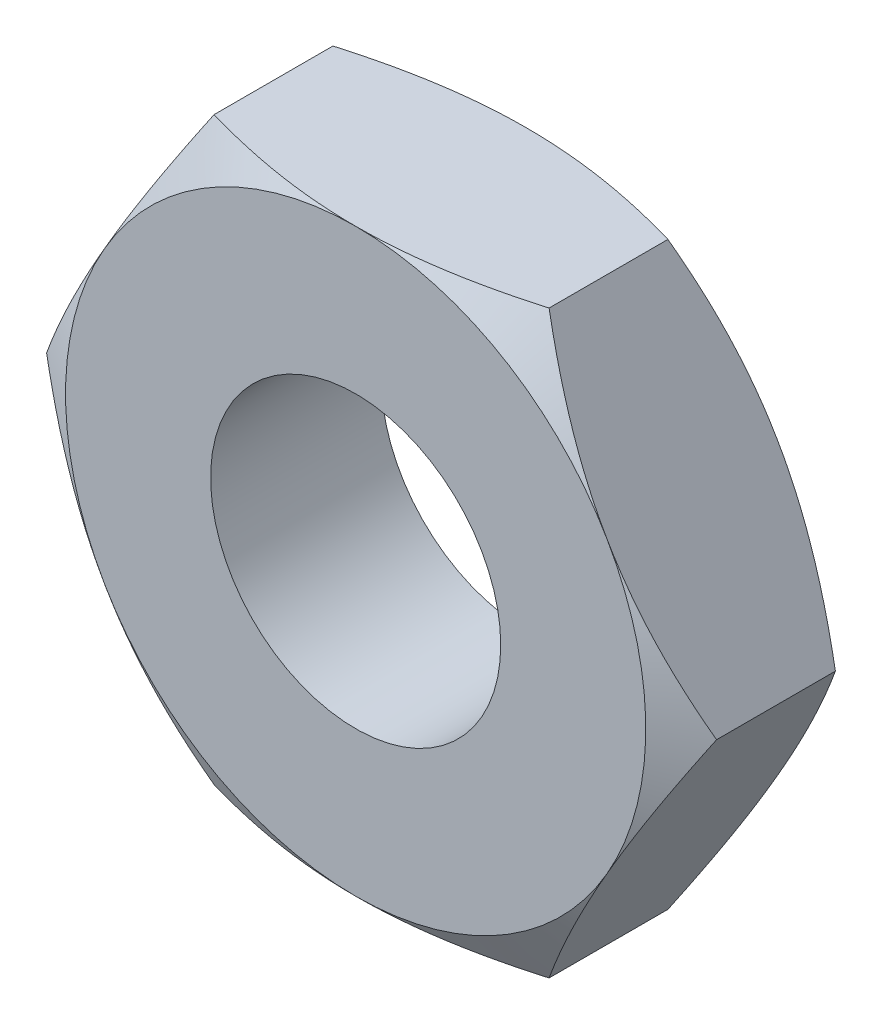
from build123d import *

# Parameters (mm, degrees)
EXTRUDE1_DEPTH = 5
TAPPED_HOLE1_D = 8.5


with BuildPart() as part:
    # Sketch1 → Extrude1 (new body)
    with BuildSketch(Plane.XY):
        Polygon((4.907477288, -8.5), (9.814954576, 0), (4.907477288, 8.5), (-4.907477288, 8.5), (-9.814954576, 0), (-4.907477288, -8.5), align=None)
    extrude(amount=EXTRUDE1_DEPTH)

    # Tapped Hole1 (through all)
    with Locations(Plane.XY.offset(5)):
        with Locations((0, 0)):
            Hole(TAPPED_HOLE1_D / 2)

    # Sketch4 → Cut-Revolve1 (revolve, cut)
    with BuildSketch(Plane(origin=(0, 0, 0), x_dir=(1, 0, 0), z_dir=(0, 1, 0)), mode=Mode.PRIVATE) as cut_revolve1_sk:
        Polygon((-9.814954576, -4.240810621), (-8.5, -5), (-9.814954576, -5), align=None)
        Polygon((-9.814954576, -0.759189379), (-8.5, 0), (-9.814954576, 0), align=None)
    revolve(cut_revolve1_sk.sketch.rotate(Axis((0, 0, 0), (0, 0, 1)), 180), axis=Axis((0, 0, 0), (0, 0, 1)), mode=Mode.SUBTRACT)


solid = part.part
